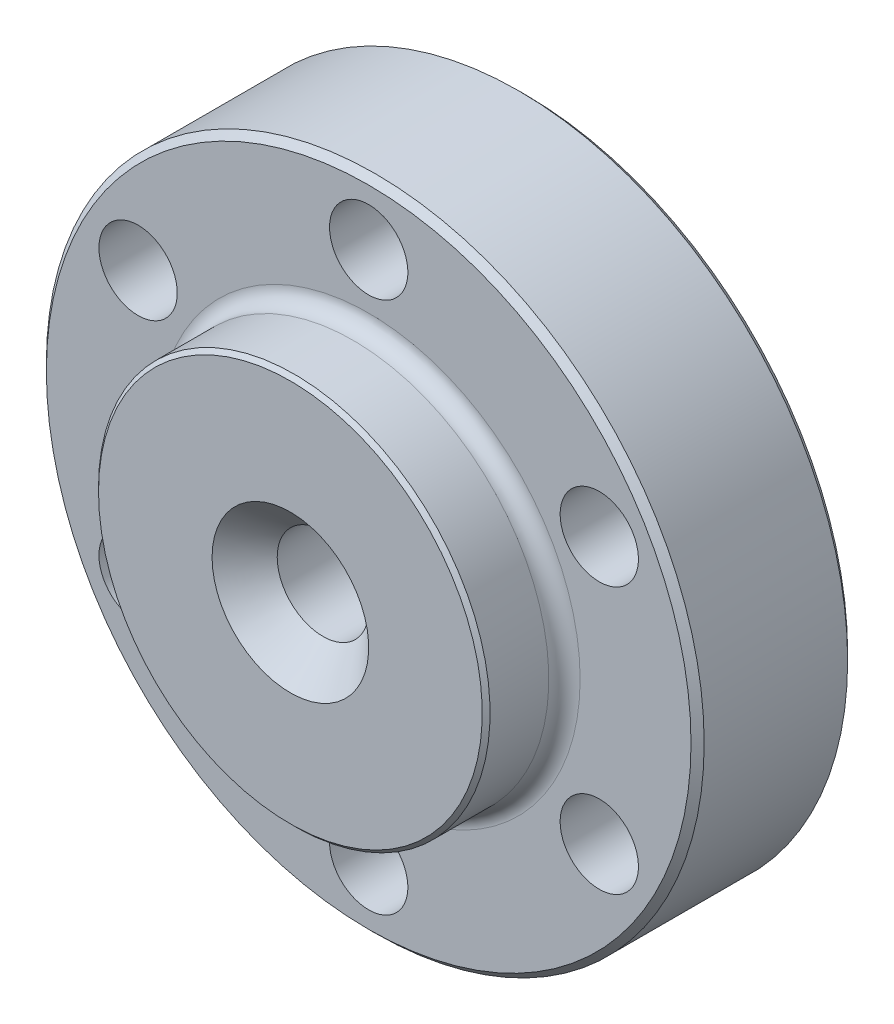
ISO-10303-21;
HEADER;
FILE_DESCRIPTION(('STEP AP214'),'2;1');
FILE_NAME('part.step','',(''),(''),'','','');
FILE_SCHEMA(('AUTOMOTIVE_DESIGN { 1 0 10303 214 1 1 1 1 }'));
ENDSEC;
DATA;
#1=APPLICATION_CONTEXT('core data for automotive mechanical design processes');
#2=APPLICATION_PROTOCOL_DEFINITION('international standard','automotive_design',2000,#1);
#3=PRODUCT_CONTEXT('',#1,'mechanical');
#4=PRODUCT('Part','Part','',(#3));
#5=PRODUCT_RELATED_PRODUCT_CATEGORY('part','',(#4));
#6=PRODUCT_DEFINITION_FORMATION('','',#4);
#7=PRODUCT_DEFINITION_CONTEXT('part definition',#1,'design');
#8=PRODUCT_DEFINITION('design','',#6,#7);
#9=PRODUCT_DEFINITION_SHAPE('','',#8);
#10=(LENGTH_UNIT() NAMED_UNIT(*) SI_UNIT(.MILLI.,.METRE.));
#11=(NAMED_UNIT(*) PLANE_ANGLE_UNIT() SI_UNIT($,.RADIAN.));
#12=(NAMED_UNIT(*) SI_UNIT($,.STERADIAN.) SOLID_ANGLE_UNIT());
#13=UNCERTAINTY_MEASURE_WITH_UNIT(LENGTH_MEASURE(1.E-05),#10,'distance_accuracy_value','');
#14=(GEOMETRIC_REPRESENTATION_CONTEXT(3) GLOBAL_UNCERTAINTY_ASSIGNED_CONTEXT((#13)) GLOBAL_UNIT_ASSIGNED_CONTEXT((#10,
#11,#12)) REPRESENTATION_CONTEXT('',''));
#15=CARTESIAN_POINT('',(0.,0.,0.));
#16=DIRECTION('',(0.,0.,1.));
#17=DIRECTION('',(1.,0.,0.));
#18=AXIS2_PLACEMENT_3D('',#15,#16,#17);
#19=CARTESIAN_POINT('',(0.,20.58,0.));
#20=DIRECTION('',(0.,0.,1.));
#21=DIRECTION('',(1.,0.,0.));
#22=AXIS2_PLACEMENT_3D('',#19,#20,#21);
#23=PLANE('',#22);
#24=CARTESIAN_POINT('',(14.7224318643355,8.5,0.));
#25=DIRECTION('',(0.,0.,1.));
#26=DIRECTION('',(1.,0.,0.));
#27=AXIS2_PLACEMENT_3D('',#24,#25,#26);
#28=CIRCLE('',#27,2.5);
#29=CARTESIAN_POINT('',(17.2224318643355,8.5,0.));
#30=VERTEX_POINT('',#29);
#31=EDGE_CURVE('E59',#30,#30,#28,.T.);
#32=ORIENTED_EDGE('',*,*,#31,.T.);
#33=EDGE_LOOP('',(#32));
#34=FACE_BOUND('',#33,.T.);
#35=CARTESIAN_POINT('',(14.7224318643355,-8.5,0.));
#36=DIRECTION('',(0.,0.,1.));
#37=DIRECTION('',(1.,0.,0.));
#38=AXIS2_PLACEMENT_3D('',#35,#36,#37);
#39=CIRCLE('',#38,2.5);
#40=CARTESIAN_POINT('',(17.2224318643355,-8.5,0.));
#41=VERTEX_POINT('',#40);
#42=EDGE_CURVE('E55',#41,#41,#39,.T.);
#43=ORIENTED_EDGE('',*,*,#42,.T.);
#44=EDGE_LOOP('',(#43));
#45=FACE_BOUND('',#44,.T.);
#46=CARTESIAN_POINT('',(0.,-17.,0.));
#47=DIRECTION('',(0.,0.,1.));
#48=DIRECTION('',(1.,0.,0.));
#49=AXIS2_PLACEMENT_3D('',#46,#47,#48);
#50=CIRCLE('',#49,2.5);
#51=CARTESIAN_POINT('',(2.5,-17.,0.));
#52=VERTEX_POINT('',#51);
#53=EDGE_CURVE('E51',#52,#52,#50,.T.);
#54=ORIENTED_EDGE('',*,*,#53,.T.);
#55=EDGE_LOOP('',(#54));
#56=FACE_BOUND('',#55,.T.);
#57=CARTESIAN_POINT('',(-14.7224318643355,-8.5,0.));
#58=DIRECTION('',(0.,0.,1.));
#59=DIRECTION('',(1.,0.,0.));
#60=AXIS2_PLACEMENT_3D('',#57,#58,#59);
#61=CIRCLE('',#60,2.5);
#62=CARTESIAN_POINT('',(-12.2224318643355,-8.5,0.));
#63=VERTEX_POINT('',#62);
#64=EDGE_CURVE('E46',#63,#63,#61,.T.);
#65=ORIENTED_EDGE('',*,*,#64,.T.);
#66=EDGE_LOOP('',(#65));
#67=FACE_BOUND('',#66,.T.);
#68=CARTESIAN_POINT('',(-14.7224318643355,8.5,0.));
#69=DIRECTION('',(0.,0.,1.));
#70=DIRECTION('',(1.,0.,0.));
#71=AXIS2_PLACEMENT_3D('',#68,#69,#70);
#72=CIRCLE('',#71,2.5);
#73=CARTESIAN_POINT('',(-12.2224318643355,8.5,0.));
#74=VERTEX_POINT('',#73);
#75=EDGE_CURVE('E41',#74,#74,#72,.T.);
#76=ORIENTED_EDGE('',*,*,#75,.T.);
#77=EDGE_LOOP('',(#76));
#78=FACE_BOUND('',#77,.T.);
#79=CARTESIAN_POINT('',(0.,17.,0.));
#80=DIRECTION('',(0.,0.,1.));
#81=DIRECTION('',(1.,0.,0.));
#82=AXIS2_PLACEMENT_3D('',#79,#80,#81);
#83=CIRCLE('',#82,2.5);
#84=CARTESIAN_POINT('',(2.5,17.,0.));
#85=VERTEX_POINT('',#84);
#86=EDGE_CURVE('E40',#85,#85,#83,.T.);
#87=ORIENTED_EDGE('',*,*,#86,.T.);
#88=EDGE_LOOP('',(#87));
#89=FACE_BOUND('',#88,.T.);
#90=CARTESIAN_POINT('',(0.,0.,0.));
#91=DIRECTION('',(0.,0.,-1.));
#92=DIRECTION('',(-1.,0.,0.));
#93=AXIS2_PLACEMENT_3D('',#90,#91,#92);
#94=CIRCLE('',#93,20.58);
#95=CARTESIAN_POINT('',(-20.58,0.,0.));
#96=VERTEX_POINT('',#95);
#97=EDGE_CURVE('E8',#96,#96,#94,.T.);
#98=ORIENTED_EDGE('',*,*,#97,.T.);
#99=EDGE_LOOP('',(#98));
#100=FACE_BOUND('',#99,.T.);
#101=CARTESIAN_POINT('',(0.,0.,0.));
#102=DIRECTION('',(0.,0.,-1.));
#103=DIRECTION('',(-1.,0.,0.));
#104=AXIS2_PLACEMENT_3D('',#101,#102,#103);
#105=CIRCLE('',#104,5.);
#106=CARTESIAN_POINT('',(-5.,0.,0.));
#107=VERTEX_POINT('',#106);
#108=EDGE_CURVE('E87',#107,#107,#105,.T.);
#109=ORIENTED_EDGE('',*,*,#108,.F.);
#110=EDGE_LOOP('',(#109));
#111=FACE_BOUND('',#110,.T.);
#112=ADVANCED_FACE('F13',(#34,#45,#56,#67,#78,#89,#100,#111),#23,.F.);
#113=CARTESIAN_POINT('',(0.,0.,15.));
#114=DIRECTION('',(0.,0.,-1.));
#115=DIRECTION('',(-1.,0.,0.));
#116=AXIS2_PLACEMENT_3D('',#113,#114,#115);
#117=PLANE('',#116);
#118=CARTESIAN_POINT('',(0.,0.,15.));
#119=DIRECTION('',(0.,0.,-1.));
#120=DIRECTION('',(-1.,0.,0.));
#121=AXIS2_PLACEMENT_3D('',#118,#119,#120);
#122=CIRCLE('',#121,12.25);
#123=CARTESIAN_POINT('',(-12.25,0.,15.));
#124=VERTEX_POINT('',#123);
#125=EDGE_CURVE('E22',#124,#124,#122,.T.);
#126=ORIENTED_EDGE('',*,*,#125,.F.);
#127=EDGE_LOOP('',(#126));
#128=FACE_BOUND('',#127,.T.);
#129=CARTESIAN_POINT('',(0.,0.,15.));
#130=DIRECTION('',(0.,0.,-1.));
#131=DIRECTION('',(-1.,0.,0.));
#132=AXIS2_PLACEMENT_3D('',#129,#130,#131);
#133=CIRCLE('',#132,5.);
#134=CARTESIAN_POINT('',(-5.,0.,15.));
#135=VERTEX_POINT('',#134);
#136=EDGE_CURVE('E98',#135,#135,#133,.T.);
#137=ORIENTED_EDGE('',*,*,#136,.T.);
#138=EDGE_LOOP('',(#137));
#139=FACE_BOUND('',#138,.T.);
#140=ADVANCED_FACE('F136',(#128,#139),#117,.F.);
#141=CARTESIAN_POINT('',(0.,0.,0.42));
#142=DIRECTION('',(0.,0.,1.));
#143=DIRECTION('',(1.,0.,0.));
#144=AXIS2_PLACEMENT_3D('',#141,#142,#143);
#145=CONICAL_SURFACE('',#144,21.,0.785398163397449);
#146=ORIENTED_EDGE('',*,*,#97,.F.);
#147=EDGE_LOOP('',(#146));
#148=FACE_BOUND('',#147,.T.);
#149=CARTESIAN_POINT('',(0.,0.,0.42));
#150=DIRECTION('',(0.,0.,-1.));
#151=DIRECTION('',(-1.,0.,0.));
#152=AXIS2_PLACEMENT_3D('',#149,#150,#151);
#153=CIRCLE('',#152,21.);
#154=CARTESIAN_POINT('',(-21.,0.,0.420000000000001));
#155=VERTEX_POINT('',#154);
#156=EDGE_CURVE('E102',#155,#155,#153,.T.);
#157=ORIENTED_EDGE('',*,*,#156,.T.);
#158=EDGE_LOOP('',(#157));
#159=FACE_BOUND('',#158,.T.);
#160=ADVANCED_FACE('F15',(#148,#159),#145,.T.);
#161=CARTESIAN_POINT('',(0.,0.,15.));
#162=DIRECTION('',(0.,0.,-1.));
#163=DIRECTION('',(-1.,0.,0.));
#164=AXIS2_PLACEMENT_3D('',#161,#162,#163);
#165=CONICAL_SURFACE('',#164,12.25,0.785398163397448);
#166=CARTESIAN_POINT('',(0.,0.,14.75));
#167=DIRECTION('',(0.,0.,-1.));
#168=DIRECTION('',(-1.,0.,0.));
#169=AXIS2_PLACEMENT_3D('',#166,#167,#168);
#170=CIRCLE('',#169,12.5);
#171=CARTESIAN_POINT('',(-12.5,0.,14.75));
#172=VERTEX_POINT('',#171);
#173=EDGE_CURVE('E32',#172,#172,#170,.T.);
#174=ORIENTED_EDGE('',*,*,#173,.F.);
#175=EDGE_LOOP('',(#174));
#176=FACE_BOUND('',#175,.T.);
#177=ORIENTED_EDGE('',*,*,#125,.T.);
#178=EDGE_LOOP('',(#177));
#179=FACE_BOUND('',#178,.T.);
#180=ADVANCED_FACE('F130',(#176,#179),#165,.T.);
#181=CARTESIAN_POINT('',(0.,0.,0.));
#182=DIRECTION('',(0.,0.,-1.));
#183=DIRECTION('',(-1.,0.,0.));
#184=AXIS2_PLACEMENT_3D('',#181,#182,#183);
#185=CYLINDRICAL_SURFACE('',#184,12.5);
#186=CARTESIAN_POINT('',(0.,0.,11.));
#187=DIRECTION('',(0.,0.,-1.));
#188=DIRECTION('',(-1.,0.,0.));
#189=AXIS2_PLACEMENT_3D('',#186,#187,#188);
#190=CIRCLE('',#189,12.5);
#191=CARTESIAN_POINT('',(-12.5,0.,11.));
#192=VERTEX_POINT('',#191);
#193=EDGE_CURVE('E118',#192,#192,#190,.T.);
#194=ORIENTED_EDGE('',*,*,#193,.F.);
#195=EDGE_LOOP('',(#194));
#196=FACE_BOUND('',#195,.T.);
#197=ORIENTED_EDGE('',*,*,#173,.T.);
#198=EDGE_LOOP('',(#197));
#199=FACE_BOUND('',#198,.T.);
#200=ADVANCED_FACE('F128',(#196,#199),#185,.T.);
#201=CARTESIAN_POINT('',(0.,0.,11.));
#202=DIRECTION('',(0.,0.,-1.));
#203=DIRECTION('',(-1.,0.,0.));
#204=AXIS2_PLACEMENT_3D('',#201,#202,#203);
#205=TOROIDAL_SURFACE('',#204,13.5,1.);
#206=ORIENTED_EDGE('',*,*,#193,.T.);
#207=EDGE_LOOP('',(#206));
#208=FACE_BOUND('',#207,.T.);
#209=CARTESIAN_POINT('',(0.,0.,10.));
#210=DIRECTION('',(0.,0.,-1.));
#211=DIRECTION('',(-1.,0.,0.));
#212=AXIS2_PLACEMENT_3D('',#209,#210,#211);
#213=CIRCLE('',#212,13.5);
#214=CARTESIAN_POINT('',(-13.5,0.,10.));
#215=VERTEX_POINT('',#214);
#216=EDGE_CURVE('E114',#215,#215,#213,.T.);
#217=ORIENTED_EDGE('',*,*,#216,.F.);
#218=EDGE_LOOP('',(#217));
#219=FACE_BOUND('',#218,.T.);
#220=ADVANCED_FACE('F166',(#208,#219),#205,.F.);
#221=CARTESIAN_POINT('',(0.,13.5,10.));
#222=DIRECTION('',(0.,0.,-1.));
#223=DIRECTION('',(-1.,0.,0.));
#224=AXIS2_PLACEMENT_3D('',#221,#222,#223);
#225=PLANE('',#224);
#226=CARTESIAN_POINT('',(14.7224318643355,8.5,10.));
#227=DIRECTION('',(0.,0.,-1.));
#228=DIRECTION('',(-1.,0.,0.));
#229=AXIS2_PLACEMENT_3D('',#226,#227,#228);
#230=CIRCLE('',#229,2.5);
#231=CARTESIAN_POINT('',(12.2224318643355,8.5,10.));
#232=VERTEX_POINT('',#231);
#233=EDGE_CURVE('E17',#232,#232,#230,.T.);
#234=ORIENTED_EDGE('',*,*,#233,.T.);
#235=EDGE_LOOP('',(#234));
#236=FACE_BOUND('',#235,.T.);
#237=CARTESIAN_POINT('',(14.7224318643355,-8.5,10.));
#238=DIRECTION('',(0.,0.,-1.));
#239=DIRECTION('',(-1.,0.,0.));
#240=AXIS2_PLACEMENT_3D('',#237,#238,#239);
#241=CIRCLE('',#240,2.5);
#242=CARTESIAN_POINT('',(12.2224318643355,-8.5,10.));
#243=VERTEX_POINT('',#242);
#244=EDGE_CURVE('E56',#243,#243,#241,.T.);
#245=ORIENTED_EDGE('',*,*,#244,.T.);
#246=EDGE_LOOP('',(#245));
#247=FACE_BOUND('',#246,.T.);
#248=CARTESIAN_POINT('',(0.,-17.,10.));
#249=DIRECTION('',(0.,0.,-1.));
#250=DIRECTION('',(-1.,0.,0.));
#251=AXIS2_PLACEMENT_3D('',#248,#249,#250);
#252=CIRCLE('',#251,2.5);
#253=CARTESIAN_POINT('',(-2.5,-17.,10.));
#254=VERTEX_POINT('',#253);
#255=EDGE_CURVE('E52',#254,#254,#252,.T.);
#256=ORIENTED_EDGE('',*,*,#255,.T.);
#257=EDGE_LOOP('',(#256));
#258=FACE_BOUND('',#257,.T.);
#259=CARTESIAN_POINT('',(-14.7224318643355,-8.5,10.));
#260=DIRECTION('',(0.,0.,-1.));
#261=DIRECTION('',(-1.,0.,0.));
#262=AXIS2_PLACEMENT_3D('',#259,#260,#261);
#263=CIRCLE('',#262,2.5);
#264=CARTESIAN_POINT('',(-17.2224318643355,-8.5,10.));
#265=VERTEX_POINT('',#264);
#266=EDGE_CURVE('E47',#265,#265,#263,.T.);
#267=ORIENTED_EDGE('',*,*,#266,.T.);
#268=EDGE_LOOP('',(#267));
#269=FACE_BOUND('',#268,.T.);
#270=CARTESIAN_POINT('',(-14.7224318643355,8.5,10.));
#271=DIRECTION('',(0.,0.,-1.));
#272=DIRECTION('',(-1.,0.,0.));
#273=AXIS2_PLACEMENT_3D('',#270,#271,#272);
#274=CIRCLE('',#273,2.5);
#275=CARTESIAN_POINT('',(-17.2224318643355,8.5,10.));
#276=VERTEX_POINT('',#275);
#277=EDGE_CURVE('E42',#276,#276,#274,.T.);
#278=ORIENTED_EDGE('',*,*,#277,.T.);
#279=EDGE_LOOP('',(#278));
#280=FACE_BOUND('',#279,.T.);
#281=CARTESIAN_POINT('',(0.,17.,10.));
#282=DIRECTION('',(0.,0.,-1.));
#283=DIRECTION('',(-1.,0.,0.));
#284=AXIS2_PLACEMENT_3D('',#281,#282,#283);
#285=CIRCLE('',#284,2.5);
#286=CARTESIAN_POINT('',(-2.5,17.,10.));
#287=VERTEX_POINT('',#286);
#288=EDGE_CURVE('E36',#287,#287,#285,.T.);
#289=ORIENTED_EDGE('',*,*,#288,.T.);
#290=EDGE_LOOP('',(#289));
#291=FACE_BOUND('',#290,.T.);
#292=CARTESIAN_POINT('',(0.,0.,10.));
#293=DIRECTION('',(0.,0.,-1.));
#294=DIRECTION('',(-1.,0.,0.));
#295=AXIS2_PLACEMENT_3D('',#292,#293,#294);
#296=CIRCLE('',#295,20.58);
#297=CARTESIAN_POINT('',(-20.58,0.,10.));
#298=VERTEX_POINT('',#297);
#299=EDGE_CURVE('E110',#298,#298,#296,.T.);
#300=ORIENTED_EDGE('',*,*,#299,.F.);
#301=EDGE_LOOP('',(#300));
#302=FACE_BOUND('',#301,.T.);
#303=ORIENTED_EDGE('',*,*,#216,.T.);
#304=EDGE_LOOP('',(#303));
#305=FACE_BOUND('',#304,.T.);
#306=ADVANCED_FACE('F170',(#236,#247,#258,#269,#280,#291,#302,#305),#225,.F.);
#307=CARTESIAN_POINT('',(0.,0.,10.));
#308=DIRECTION('',(0.,0.,-1.));
#309=DIRECTION('',(-1.,0.,0.));
#310=AXIS2_PLACEMENT_3D('',#307,#308,#309);
#311=CONICAL_SURFACE('',#310,20.58,0.785398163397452);
#312=CARTESIAN_POINT('',(0.,0.,9.58));
#313=DIRECTION('',(0.,0.,-1.));
#314=DIRECTION('',(-1.,0.,0.));
#315=AXIS2_PLACEMENT_3D('',#312,#313,#314);
#316=CIRCLE('',#315,21.);
#317=CARTESIAN_POINT('',(-21.,0.,9.58));
#318=VERTEX_POINT('',#317);
#319=EDGE_CURVE('E106',#318,#318,#316,.T.);
#320=ORIENTED_EDGE('',*,*,#319,.F.);
#321=EDGE_LOOP('',(#320));
#322=FACE_BOUND('',#321,.T.);
#323=ORIENTED_EDGE('',*,*,#299,.T.);
#324=EDGE_LOOP('',(#323));
#325=FACE_BOUND('',#324,.T.);
#326=ADVANCED_FACE('F156',(#322,#325),#311,.T.);
#327=CARTESIAN_POINT('',(0.,0.,0.));
#328=DIRECTION('',(0.,0.,-1.));
#329=DIRECTION('',(-1.,0.,0.));
#330=AXIS2_PLACEMENT_3D('',#327,#328,#329);
#331=CYLINDRICAL_SURFACE('',#330,21.);
#332=ORIENTED_EDGE('',*,*,#156,.F.);
#333=EDGE_LOOP('',(#332));
#334=FACE_BOUND('',#333,.T.);
#335=ORIENTED_EDGE('',*,*,#319,.T.);
#336=EDGE_LOOP('',(#335));
#337=FACE_BOUND('',#336,.T.);
#338=ADVANCED_FACE('F145',(#334,#337),#331,.T.);
#339=CARTESIAN_POINT('',(0.,0.,15.));
#340=DIRECTION('',(0.,0.,1.));
#341=DIRECTION('',(1.,0.,0.));
#342=AXIS2_PLACEMENT_3D('',#339,#340,#341);
#343=CONICAL_SURFACE('',#342,5.,0.785398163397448);
#344=CARTESIAN_POINT('',(0.,0.,12.92));
#345=DIRECTION('',(0.,0.,-1.));
#346=DIRECTION('',(-1.,0.,0.));
#347=AXIS2_PLACEMENT_3D('',#344,#345,#346);
#348=CIRCLE('',#347,2.92);
#349=CARTESIAN_POINT('',(-2.92,0.,12.92));
#350=VERTEX_POINT('',#349);
#351=EDGE_CURVE('E94',#350,#350,#348,.T.);
#352=ORIENTED_EDGE('',*,*,#351,.T.);
#353=EDGE_LOOP('',(#352));
#354=FACE_BOUND('',#353,.T.);
#355=ORIENTED_EDGE('',*,*,#136,.F.);
#356=EDGE_LOOP('',(#355));
#357=FACE_BOUND('',#356,.T.);
#358=ADVANCED_FACE('F142',(#354,#357),#343,.F.);
#359=CARTESIAN_POINT('',(0.,0.,-1.));
#360=DIRECTION('',(0.,0.,-1.));
#361=DIRECTION('',(-1.,0.,0.));
#362=AXIS2_PLACEMENT_3D('',#359,#360,#361);
#363=CYLINDRICAL_SURFACE('',#362,2.92);
#364=CARTESIAN_POINT('',(0.,0.,2.08));
#365=DIRECTION('',(0.,0.,-1.));
#366=DIRECTION('',(-1.,0.,0.));
#367=AXIS2_PLACEMENT_3D('',#364,#365,#366);
#368=CIRCLE('',#367,2.92);
#369=CARTESIAN_POINT('',(-2.92,0.,2.08));
#370=VERTEX_POINT('',#369);
#371=EDGE_CURVE('E90',#370,#370,#368,.T.);
#372=ORIENTED_EDGE('',*,*,#371,.T.);
#373=EDGE_LOOP('',(#372));
#374=FACE_BOUND('',#373,.T.);
#375=ORIENTED_EDGE('',*,*,#351,.F.);
#376=EDGE_LOOP('',(#375));
#377=FACE_BOUND('',#376,.T.);
#378=ADVANCED_FACE('F144',(#374,#377),#363,.F.);
#379=CARTESIAN_POINT('',(0.,0.,2.08));
#380=DIRECTION('',(0.,0.,-1.));
#381=DIRECTION('',(-1.,0.,0.));
#382=AXIS2_PLACEMENT_3D('',#379,#380,#381);
#383=CONICAL_SURFACE('',#382,2.92,0.785398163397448);
#384=ORIENTED_EDGE('',*,*,#108,.T.);
#385=EDGE_LOOP('',(#384));
#386=FACE_BOUND('',#385,.T.);
#387=ORIENTED_EDGE('',*,*,#371,.F.);
#388=EDGE_LOOP('',(#387));
#389=FACE_BOUND('',#388,.T.);
#390=ADVANCED_FACE('F153',(#386,#389),#383,.F.);
#391=CARTESIAN_POINT('',(0.,17.,-1.));
#392=DIRECTION('',(0.,0.,1.));
#393=DIRECTION('',(0.,-1.,0.));
#394=AXIS2_PLACEMENT_3D('',#391,#392,#393);
#395=CYLINDRICAL_SURFACE('',#394,2.5);
#396=ORIENTED_EDGE('',*,*,#288,.F.);
#397=EDGE_LOOP('',(#396));
#398=FACE_BOUND('',#397,.T.);
#399=ORIENTED_EDGE('',*,*,#86,.F.);
#400=EDGE_LOOP('',(#399));
#401=FACE_BOUND('',#400,.T.);
#402=ADVANCED_FACE('F219',(#398,#401),#395,.F.);
#403=CARTESIAN_POINT('',(-14.7224318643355,8.5,-1.));
#404=DIRECTION('',(0.,0.,1.));
#405=DIRECTION('',(0.866025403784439,-0.5,0.));
#406=AXIS2_PLACEMENT_3D('',#403,#404,#405);
#407=CYLINDRICAL_SURFACE('',#406,2.5);
#408=ORIENTED_EDGE('',*,*,#277,.F.);
#409=EDGE_LOOP('',(#408));
#410=FACE_BOUND('',#409,.T.);
#411=ORIENTED_EDGE('',*,*,#75,.F.);
#412=EDGE_LOOP('',(#411));
#413=FACE_BOUND('',#412,.T.);
#414=ADVANCED_FACE('F229',(#410,#413),#407,.F.);
#415=CARTESIAN_POINT('',(-14.7224318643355,-8.5,-1.));
#416=DIRECTION('',(0.,0.,1.));
#417=DIRECTION('',(0.866025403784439,0.5,0.));
#418=AXIS2_PLACEMENT_3D('',#415,#416,#417);
#419=CYLINDRICAL_SURFACE('',#418,2.5);
#420=ORIENTED_EDGE('',*,*,#266,.F.);
#421=EDGE_LOOP('',(#420));
#422=FACE_BOUND('',#421,.T.);
#423=ORIENTED_EDGE('',*,*,#64,.F.);
#424=EDGE_LOOP('',(#423));
#425=FACE_BOUND('',#424,.T.);
#426=ADVANCED_FACE('F239',(#422,#425),#419,.F.);
#427=CARTESIAN_POINT('',(0.,-17.,-1.));
#428=DIRECTION('',(0.,0.,1.));
#429=DIRECTION('',(0.,1.,0.));
#430=AXIS2_PLACEMENT_3D('',#427,#428,#429);
#431=CYLINDRICAL_SURFACE('',#430,2.5);
#432=ORIENTED_EDGE('',*,*,#255,.F.);
#433=EDGE_LOOP('',(#432));
#434=FACE_BOUND('',#433,.T.);
#435=ORIENTED_EDGE('',*,*,#53,.F.);
#436=EDGE_LOOP('',(#435));
#437=FACE_BOUND('',#436,.T.);
#438=ADVANCED_FACE('F249',(#434,#437),#431,.F.);
#439=CARTESIAN_POINT('',(14.7224318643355,-8.5,-1.));
#440=DIRECTION('',(0.,0.,1.));
#441=DIRECTION('',(-0.866025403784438,0.5,0.));
#442=AXIS2_PLACEMENT_3D('',#439,#440,#441);
#443=CYLINDRICAL_SURFACE('',#442,2.5);
#444=ORIENTED_EDGE('',*,*,#244,.F.);
#445=EDGE_LOOP('',(#444));
#446=FACE_BOUND('',#445,.T.);
#447=ORIENTED_EDGE('',*,*,#42,.F.);
#448=EDGE_LOOP('',(#447));
#449=FACE_BOUND('',#448,.T.);
#450=ADVANCED_FACE('F259',(#446,#449),#443,.F.);
#451=CARTESIAN_POINT('',(14.7224318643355,8.5,-1.));
#452=DIRECTION('',(0.,0.,1.));
#453=DIRECTION('',(-0.866025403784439,-0.5,0.));
#454=AXIS2_PLACEMENT_3D('',#451,#452,#453);
#455=CYLINDRICAL_SURFACE('',#454,2.5);
#456=ORIENTED_EDGE('',*,*,#233,.F.);
#457=EDGE_LOOP('',(#456));
#458=FACE_BOUND('',#457,.T.);
#459=ORIENTED_EDGE('',*,*,#31,.F.);
#460=EDGE_LOOP('',(#459));
#461=FACE_BOUND('',#460,.T.);
#462=ADVANCED_FACE('F269',(#458,#461),#455,.F.);
#463=CLOSED_SHELL('',(#112,#140,#160,#180,#200,#220,#306,#326,#338,#358,#378,#390,#402,#414,
#426,#438,#450,#462));
#464=MANIFOLD_SOLID_BREP('B1',#463);
#465=ADVANCED_BREP_SHAPE_REPRESENTATION('',(#18,#464),#14);
#466=SHAPE_DEFINITION_REPRESENTATION(#9,#465);
ENDSEC;
END-ISO-10303-21;
